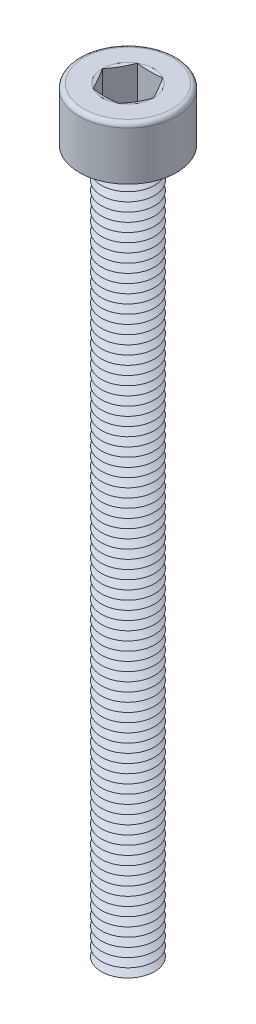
from build123d import *

# Parameters (mm, degrees)
SKETCH1_R       = 1.5
EXTRUDE1_DEPTH  = 40
SKETCH2_R       = 2.75
EXTRUDE2_DEPTH  = 3
EXTRUDE3_DEPTH  = 2.5
FILLET1_R       = 0.25
LPATTERN1_COUNT = 80
LPATTERN1_PITCH = 0.5


with BuildPart() as part:
    # Sketch1 → Extrude1 (new body)
    with BuildSketch(Plane(origin=(0, 0, 0), x_dir=(1, 0, 0), z_dir=(0, 1, 0))):
        with Locations(Location((0, 0, 0), (0, 0, 270))):
            Circle(SKETCH1_R)
    extrude(amount=EXTRUDE1_DEPTH)

    # Sketch2 → Extrude2 (add)
    with BuildSketch(Plane(origin=(0, 40, 0), x_dir=(1, 0, 0), z_dir=(0, 1, 0))):
        with Locations(Location((0, 0, 0), (0, 0, 270))):
            Circle(SKETCH2_R)
    extrude(amount=EXTRUDE2_DEPTH)

    # Sketch3 → Extrude3 (cut)
    with BuildSketch(Plane(origin=(0, 43, 0), x_dir=(1, 0, 0), z_dir=(0, 1, 0))):
        Polygon((0.721687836, 1.25), (-0.721687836, 1.25), (-1.443375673, 0), (-0.721687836, -1.25), (0.721687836, -1.25), (1.443375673, 0), align=None)
    extrude(amount=-EXTRUDE3_DEPTH, mode=Mode.SUBTRACT)

    # Fillet1
    fillet1_edges = [part.edges().sort_by_distance(p)[0] for p in [
        (0, 43, -2.75),
    ]]
    fillet(fillet1_edges, radius=FILLET1_R)

    # Sketch4 → Cut-Revolve1 (revolve, cut)
    with BuildSketch(Plane(origin=(0, 0, 0), x_dir=(0, 0, -1), z_dir=(1, 0, 0))):
        Polygon((-1.25, 40.5), (0, 40.5), (0, 39.778312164), align=None)
    revolve(axis=Axis((0, 40.5, 0), (0, -1, 0)), mode=Mode.SUBTRACT)

    # Sketch5 → Cut-Revolve2 (revolve, cut)
    with BuildSketch(Plane.XY, mode=Mode.PRIVATE) as cut_revolve2_sk:
        Polygon((-1.5, 0.25), (-1.5, -0.25), (-1.066987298, 0), align=None)
    cut_revolve2 = revolve(cut_revolve2_sk.sketch.rotate(Axis((0, 40, 0), (0, -1, 0)), 270), axis=Axis((0, 40, 0), (0, -1, 0)), mode=Mode.SUBTRACT)

    # LPattern1: Cut-Revolve2 ×80
    with Locations(*[(0, i * LPATTERN1_PITCH, 0) for i in range(1, LPATTERN1_COUNT)]):
        add(cut_revolve2, mode=Mode.SUBTRACT)

    # Extrude4 cone 1 section (on through the dimple's axis) → Extrude4 (revolve, cut)
    with BuildSketch(Plane(origin=(0, 43, 0), x_dir=(0, 0, 1), z_dir=(1, 0, 0))):
        Polygon((0, 0), (1.443375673, 0), (0, 0.386751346), align=None)
    revolve(axis=Axis((0, 43, 0), (0, -1, 0)), mode=Mode.SUBTRACT)


solid = part.part
